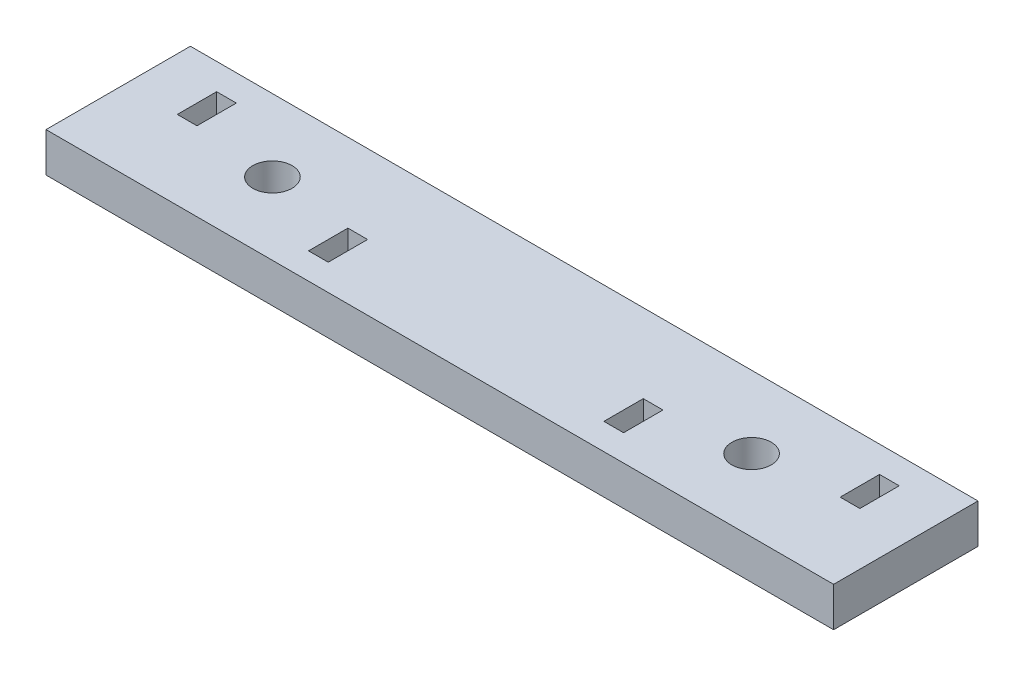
from build123d import *

# Parameters (mm, degrees)
SKETCH1_W           = 190.5
SKETCH1_H           = 69.85
BOSS_EXTRUDE1_DEPTH = 19.05


with BuildPart() as part:
    # Sketch1 → Boss-Extrude1 (new body)
    # profile 1 of 2: a face of its own
    with BuildSketch(Plane(origin=(0, 0, 0), x_dir=(1, 0, 0), z_dir=(0, 1, 0))):
        Polygon((381, 57.15), (381, 69.85), (190.5, 69.85), (190.5, 0), (381, 0), (381, 12.7), align=None)
        Polygon((266.7, 22.225), (266.7, 12.7), (257.175, 12.7), (257.175, 22.225), (257.175, 31.75), (266.7, 31.75), align=None, mode=Mode.SUBTRACT)
        with BuildLine():
            ThreePointArc((306.3875, 44.45), (313.122692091, 41.660192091), (315.9125, 34.925))
            ThreePointArc((315.9125, 34.925), (306.3875, 25.4), (296.8625, 34.925))
            ThreePointArc((296.8625, 34.925), (299.652307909, 41.660192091), (306.3875, 44.45))
        make_face(mode=Mode.SUBTRACT)
        Polygon((346.075, 57.15), (355.6, 57.15), (355.6, 47.625), (355.6, 38.1), (346.075, 38.1), (346.075, 47.625), align=None, mode=Mode.SUBTRACT)
    # profile 2 of 2: a face of its own
    with BuildSketch(Plane(origin=(0, 0, 0), x_dir=(1, 0, 0), z_dir=(0, 1, 0))):
        with Locations((95.25, 34.925)):
            Rectangle(SKETCH1_W, SKETCH1_H)
        with BuildLine():
            ThreePointArc((84.1375, 34.925), (74.6125, 25.4), (65.0875, 34.925))
            ThreePointArc((65.0875, 34.925), (67.877307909, 41.660192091), (74.6125, 44.45))
            ThreePointArc((74.6125, 44.45), (81.347692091, 41.660192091), (84.1375, 34.925))
        make_face(mode=Mode.SUBTRACT)
        Polygon((123.825, 22.225), (123.825, 12.7), (114.3, 12.7), (114.3, 22.225), (114.3, 31.75), (123.825, 31.75), align=None, mode=Mode.SUBTRACT)
        Polygon((25.4, 57.15), (34.925, 57.15), (34.925, 47.625), (34.925, 38.1), (25.4, 38.1), (25.4, 47.625), align=None, mode=Mode.SUBTRACT)
    extrude(amount=BOSS_EXTRUDE1_DEPTH)


solid = part.part
